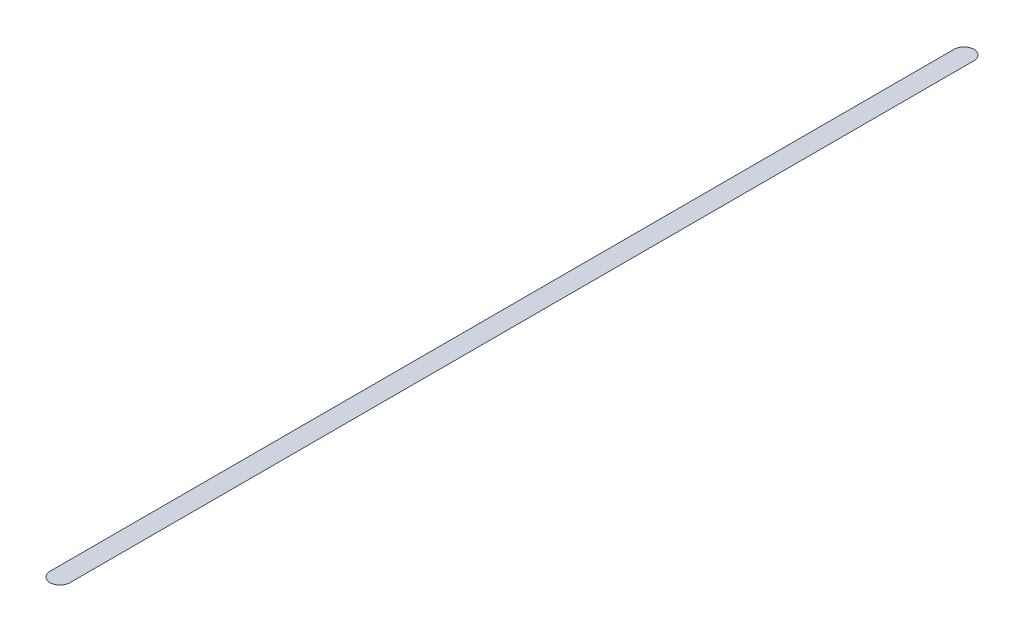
from build123d import *
from build123d.topology import SkipClean

# Parameters (mm, degrees)
SKETCH1_W           = 50
SKETCH1_H           = 5
BASE_EXTRUDE_DEPTH  = 101.6
BOSS_EXTRUDE1_DEPTH = 176.53
BOSS_REVOLVE3_ANGLE = 180
BOSS_REVOLVE4_ANGLE = 180
FILLET3_R           = 1.524
SKETCH3_W           = 203.2
SKETCH3_H           = 5
CUT_EXTRUDE1_DEPTH  = 114.347077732


with BuildPart() as part:
    # Sketch1 → Base-Extrude (new, symmetric)
    with BuildSketch(Plane.XY):
        with Locations((0, 2.5)):
            Rectangle(SKETCH1_W, SKETCH1_H)
    extrude(amount=BASE_EXTRUDE_DEPTH, both=True)

    # Sketch2 → Boss-Extrude1 (add)
    with BuildSketch(Plane.XY.offset(-88.265)):
        with BuildLine():
            Line((-0.254, 0), (0.254, 0))
            ThreePointArc((0.254, 0), (0, -1.216987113), (-0.254, 0))
        make_face()
    extrude(amount=BOSS_EXTRUDE1_DEPTH)

    # Sketch7 → Boss-Revolve3 (revolve)
    with SkipClean():  # the faces are left unmerged after this step: merging them gives an invalid solid
        with BuildSketch(Plane.XY.offset(88.265)):
            with BuildLine():
                Line((0.254, 0), (0, 0))
                Line((0, 0), (0, -1.216987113))
                ThreePointArc((0, -1.216987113), (0.621605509, -0.711723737), (0.254, 0))
            make_face()
            with BuildLine():
                Line((0, -1.216987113), (0, 0))
                Line((0, 0), (-0.254, 0))
                ThreePointArc((-0.254, 0), (-0.621605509, -0.711723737), (0, -1.216987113))
            make_face()
        revolve(axis=Axis((0, 0, 88.265), (0, -1, 0)), revolution_arc=BOSS_REVOLVE3_ANGLE)

    # Sketch9 → Boss-Revolve4 (revolve)
    with BuildSketch(Plane.XY.offset(-88.265)):
        with BuildLine():
            Line((0, 0), (0, -1.216987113))
            ThreePointArc((0, -1.216987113), (-0.621605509, -0.711723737), (-0.254, 0))
            Line((-0.254, 0), (0, 0))
        make_face()
    revolve(axis=Axis((0, 0, -88.265), (0, -1, 0)), revolution_arc=BOSS_REVOLVE4_ANGLE)

    # Fillet3
    fillet3_edges = [part.edges().sort_by_distance(p)[0] for p in [
        (0.254, 0, 0),
        (-0.254, 0, 0),
        (0, 0, 88.519),
        (0, 0, -88.519),
    ]]
    fillet(fillet3_edges, radius=FILLET3_R)

    # Sketch3 → Cut-Extrude1 (cut, through all)
    with BuildSketch(Plane.ZY.offset(25)):
        with Locations((0, 2.5)):
            Rectangle(SKETCH3_W, SKETCH3_H)
    extrude(amount=-CUT_EXTRUDE1_DEPTH, mode=Mode.SUBTRACT)


solid = part.part
